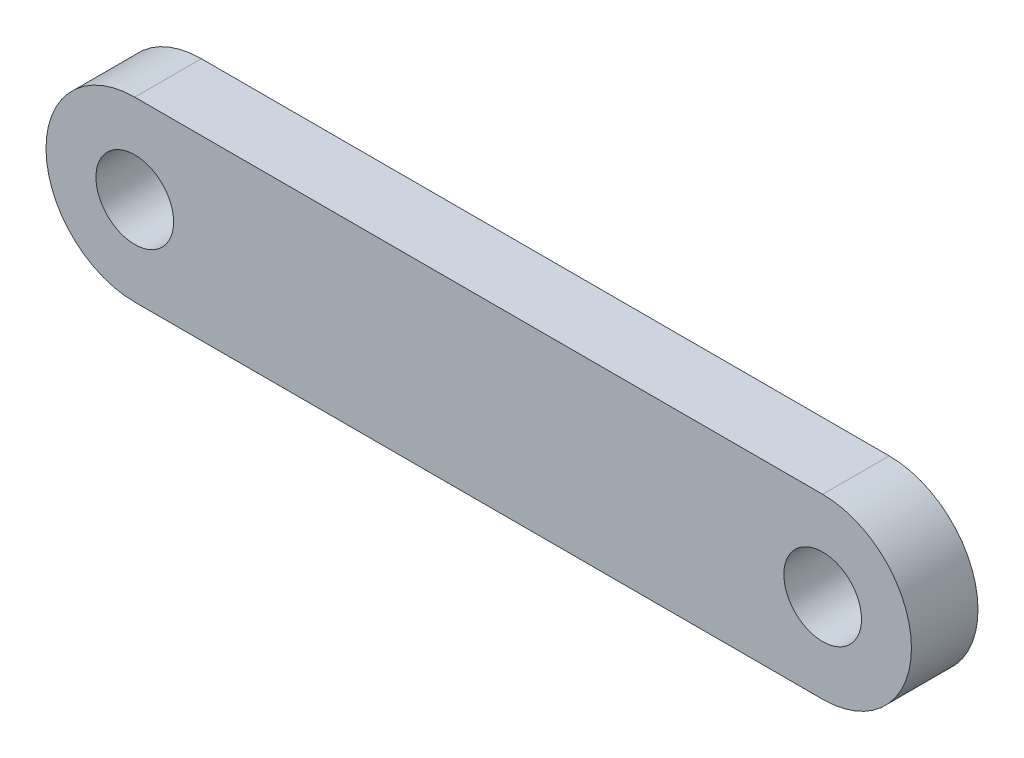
ISO-10303-21;
HEADER;
FILE_DESCRIPTION(('STEP AP214'),'2;1');
FILE_NAME('part.step','',(''),(''),'','','');
FILE_SCHEMA(('AUTOMOTIVE_DESIGN { 1 0 10303 214 1 1 1 1 }'));
ENDSEC;
DATA;
#1=APPLICATION_CONTEXT('core data for automotive mechanical design processes');
#2=APPLICATION_PROTOCOL_DEFINITION('international standard','automotive_design',2000,#1);
#3=PRODUCT_CONTEXT('',#1,'mechanical');
#4=PRODUCT('Part','Part','',(#3));
#5=PRODUCT_RELATED_PRODUCT_CATEGORY('part','',(#4));
#6=PRODUCT_DEFINITION_FORMATION('','',#4);
#7=PRODUCT_DEFINITION_CONTEXT('part definition',#1,'design');
#8=PRODUCT_DEFINITION('design','',#6,#7);
#9=PRODUCT_DEFINITION_SHAPE('','',#8);
#10=(LENGTH_UNIT() NAMED_UNIT(*) SI_UNIT(.MILLI.,.METRE.));
#11=(NAMED_UNIT(*) PLANE_ANGLE_UNIT() SI_UNIT($,.RADIAN.));
#12=(NAMED_UNIT(*) SI_UNIT($,.STERADIAN.) SOLID_ANGLE_UNIT());
#13=UNCERTAINTY_MEASURE_WITH_UNIT(LENGTH_MEASURE(1.E-05),#10,'distance_accuracy_value','');
#14=(GEOMETRIC_REPRESENTATION_CONTEXT(3) GLOBAL_UNCERTAINTY_ASSIGNED_CONTEXT((#13)) GLOBAL_UNIT_ASSIGNED_CONTEXT((#10,
#11,#12)) REPRESENTATION_CONTEXT('',''));
#15=CARTESIAN_POINT('',(0.,0.,0.));
#16=DIRECTION('',(0.,0.,1.));
#17=DIRECTION('',(1.,0.,0.));
#18=AXIS2_PLACEMENT_3D('',#15,#16,#17);
#19=CARTESIAN_POINT('',(0.,0.,3.));
#20=DIRECTION('',(0.,0.,1.));
#21=DIRECTION('',(1.,0.,0.));
#22=AXIS2_PLACEMENT_3D('',#19,#20,#21);
#23=PLANE('',#22);
#24=CARTESIAN_POINT('',(0.,0.,3.));
#25=DIRECTION('',(0.,0.,1.));
#26=DIRECTION('',(1.,0.,0.));
#27=AXIS2_PLACEMENT_3D('',#24,#25,#26);
#28=CIRCLE('',#27,1.75);
#29=CARTESIAN_POINT('',(1.75,0.,3.));
#30=VERTEX_POINT('',#29);
#31=EDGE_CURVE('E106',#30,#30,#28,.T.);
#32=ORIENTED_EDGE('',*,*,#31,.F.);
#33=EDGE_LOOP('',(#32));
#34=FACE_BOUND('',#33,.T.);
#35=CARTESIAN_POINT('',(0.,0.,3.));
#36=DIRECTION('',(0.,0.,1.));
#37=DIRECTION('',(1.,0.,0.));
#38=AXIS2_PLACEMENT_3D('',#35,#36,#37);
#39=CIRCLE('',#38,4.);
#40=CARTESIAN_POINT('',(0.,4.,3.));
#41=VERTEX_POINT('',#40);
#42=CARTESIAN_POINT('',(0.,-4.,3.));
#43=VERTEX_POINT('',#42);
#44=EDGE_CURVE('E91',#41,#43,#39,.T.);
#45=ORIENTED_EDGE('',*,*,#44,.T.);
#46=DIRECTION('',(1.,0.,0.));
#47=VECTOR('',#46,1.);
#48=CARTESIAN_POINT('',(0.,-4.,3.));
#49=LINE('',#48,#47);
#50=CARTESIAN_POINT('',(31.,-4.,3.));
#51=VERTEX_POINT('',#50);
#52=EDGE_CURVE('E86',#43,#51,#49,.T.);
#53=ORIENTED_EDGE('',*,*,#52,.T.);
#54=CARTESIAN_POINT('',(31.,0.,3.));
#55=DIRECTION('',(0.,0.,1.));
#56=DIRECTION('',(1.,0.,0.));
#57=AXIS2_PLACEMENT_3D('',#54,#55,#56);
#58=CIRCLE('',#57,4.);
#59=CARTESIAN_POINT('',(31.,4.,3.));
#60=VERTEX_POINT('',#59);
#61=EDGE_CURVE('E89',#51,#60,#58,.T.);
#62=ORIENTED_EDGE('',*,*,#61,.T.);
#63=DIRECTION('',(-1.,0.,0.));
#64=VECTOR('',#63,1.);
#65=CARTESIAN_POINT('',(0.,4.,3.));
#66=LINE('',#65,#64);
#67=EDGE_CURVE('E56',#60,#41,#66,.T.);
#68=ORIENTED_EDGE('',*,*,#67,.T.);
#69=EDGE_LOOP('',(#45,#53,#62,#68));
#70=FACE_BOUND('',#69,.T.);
#71=CARTESIAN_POINT('',(31.,0.,3.));
#72=DIRECTION('',(0.,0.,1.));
#73=DIRECTION('',(1.,0.,0.));
#74=AXIS2_PLACEMENT_3D('',#71,#72,#73);
#75=CIRCLE('',#74,1.75);
#76=CARTESIAN_POINT('',(32.75,0.,3.));
#77=VERTEX_POINT('',#76);
#78=EDGE_CURVE('E121',#77,#77,#75,.T.);
#79=ORIENTED_EDGE('',*,*,#78,.F.);
#80=EDGE_LOOP('',(#79));
#81=FACE_BOUND('',#80,.T.);
#82=ADVANCED_FACE('F39',(#34,#70,#81),#23,.T.);
#83=CARTESIAN_POINT('',(0.,0.,0.));
#84=DIRECTION('',(0.,0.,1.));
#85=DIRECTION('',(1.,0.,0.));
#86=AXIS2_PLACEMENT_3D('',#83,#84,#85);
#87=PLANE('',#86);
#88=CARTESIAN_POINT('',(0.,0.,0.));
#89=DIRECTION('',(0.,0.,1.));
#90=DIRECTION('',(1.,0.,0.));
#91=AXIS2_PLACEMENT_3D('',#88,#89,#90);
#92=CIRCLE('',#91,4.);
#93=CARTESIAN_POINT('',(0.,4.,0.));
#94=VERTEX_POINT('',#93);
#95=CARTESIAN_POINT('',(0.,-4.,0.));
#96=VERTEX_POINT('',#95);
#97=EDGE_CURVE('E103',#94,#96,#92,.T.);
#98=ORIENTED_EDGE('',*,*,#97,.F.);
#99=DIRECTION('',(-1.,0.,0.));
#100=VECTOR('',#99,1.);
#101=CARTESIAN_POINT('',(0.,4.,0.));
#102=LINE('',#101,#100);
#103=CARTESIAN_POINT('',(31.,4.,0.));
#104=VERTEX_POINT('',#103);
#105=EDGE_CURVE('E79',#104,#94,#102,.T.);
#106=ORIENTED_EDGE('',*,*,#105,.F.);
#107=CARTESIAN_POINT('',(31.,0.,0.));
#108=DIRECTION('',(0.,0.,1.));
#109=DIRECTION('',(1.,0.,0.));
#110=AXIS2_PLACEMENT_3D('',#107,#108,#109);
#111=CIRCLE('',#110,4.);
#112=CARTESIAN_POINT('',(31.,-4.,0.));
#113=VERTEX_POINT('',#112);
#114=EDGE_CURVE('E73',#113,#104,#111,.T.);
#115=ORIENTED_EDGE('',*,*,#114,.F.);
#116=DIRECTION('',(1.,0.,0.));
#117=VECTOR('',#116,1.);
#118=CARTESIAN_POINT('',(0.,-4.,0.));
#119=LINE('',#118,#117);
#120=EDGE_CURVE('E95',#96,#113,#119,.T.);
#121=ORIENTED_EDGE('',*,*,#120,.F.);
#122=EDGE_LOOP('',(#98,#106,#115,#121));
#123=FACE_BOUND('',#122,.T.);
#124=CARTESIAN_POINT('',(0.,0.,0.));
#125=DIRECTION('',(0.,0.,1.));
#126=DIRECTION('',(1.,0.,0.));
#127=AXIS2_PLACEMENT_3D('',#124,#125,#126);
#128=CIRCLE('',#127,1.75);
#129=CARTESIAN_POINT('',(1.75,0.,0.));
#130=VERTEX_POINT('',#129);
#131=EDGE_CURVE('E118',#130,#130,#128,.T.);
#132=ORIENTED_EDGE('',*,*,#131,.T.);
#133=EDGE_LOOP('',(#132));
#134=FACE_BOUND('',#133,.T.);
#135=CARTESIAN_POINT('',(31.,0.,0.));
#136=DIRECTION('',(0.,0.,1.));
#137=DIRECTION('',(1.,0.,0.));
#138=AXIS2_PLACEMENT_3D('',#135,#136,#137);
#139=CIRCLE('',#138,1.75);
#140=CARTESIAN_POINT('',(32.75,0.,0.));
#141=VERTEX_POINT('',#140);
#142=EDGE_CURVE('E124',#141,#141,#139,.T.);
#143=ORIENTED_EDGE('',*,*,#142,.T.);
#144=EDGE_LOOP('',(#143));
#145=FACE_BOUND('',#144,.T.);
#146=ADVANCED_FACE('F114',(#123,#134,#145),#87,.F.);
#147=CARTESIAN_POINT('',(0.,0.,3.));
#148=DIRECTION('',(0.,0.,-1.));
#149=DIRECTION('',(-1.,0.,0.));
#150=AXIS2_PLACEMENT_3D('',#147,#148,#149);
#151=CYLINDRICAL_SURFACE('',#150,4.);
#152=ORIENTED_EDGE('',*,*,#97,.T.);
#153=DIRECTION('',(0.,0.,-1.));
#154=VECTOR('',#153,1.);
#155=CARTESIAN_POINT('',(0.,-4.,3.));
#156=LINE('',#155,#154);
#157=EDGE_CURVE('E11',#43,#96,#156,.T.);
#158=ORIENTED_EDGE('',*,*,#157,.F.);
#159=ORIENTED_EDGE('',*,*,#44,.F.);
#160=DIRECTION('',(0.,0.,-1.));
#161=VECTOR('',#160,1.);
#162=CARTESIAN_POINT('',(0.,4.,3.));
#163=LINE('',#162,#161);
#164=EDGE_CURVE('E99',#41,#94,#163,.T.);
#165=ORIENTED_EDGE('',*,*,#164,.T.);
#166=EDGE_LOOP('',(#152,#158,#159,#165));
#167=FACE_BOUND('',#166,.T.);
#168=ADVANCED_FACE('F41',(#167),#151,.T.);
#169=CARTESIAN_POINT('',(0.,-4.,3.));
#170=DIRECTION('',(0.,1.,0.));
#171=DIRECTION('',(0.,0.,1.));
#172=AXIS2_PLACEMENT_3D('',#169,#170,#171);
#173=PLANE('',#172);
#174=ORIENTED_EDGE('',*,*,#120,.T.);
#175=DIRECTION('',(0.,0.,-1.));
#176=VECTOR('',#175,1.);
#177=CARTESIAN_POINT('',(31.,-4.,3.));
#178=LINE('',#177,#176);
#179=EDGE_CURVE('E48',#51,#113,#178,.T.);
#180=ORIENTED_EDGE('',*,*,#179,.F.);
#181=ORIENTED_EDGE('',*,*,#52,.F.);
#182=ORIENTED_EDGE('',*,*,#157,.T.);
#183=EDGE_LOOP('',(#174,#180,#181,#182));
#184=FACE_BOUND('',#183,.T.);
#185=ADVANCED_FACE('F94',(#184),#173,.F.);
#186=CARTESIAN_POINT('',(31.,0.,3.));
#187=DIRECTION('',(0.,0.,-1.));
#188=DIRECTION('',(-1.,0.,0.));
#189=AXIS2_PLACEMENT_3D('',#186,#187,#188);
#190=CYLINDRICAL_SURFACE('',#189,4.);
#191=ORIENTED_EDGE('',*,*,#114,.T.);
#192=DIRECTION('',(0.,0.,-1.));
#193=VECTOR('',#192,1.);
#194=CARTESIAN_POINT('',(31.,4.,3.));
#195=LINE('',#194,#193);
#196=EDGE_CURVE('E96',#60,#104,#195,.T.);
#197=ORIENTED_EDGE('',*,*,#196,.F.);
#198=ORIENTED_EDGE('',*,*,#61,.F.);
#199=ORIENTED_EDGE('',*,*,#179,.T.);
#200=EDGE_LOOP('',(#191,#197,#198,#199));
#201=FACE_BOUND('',#200,.T.);
#202=ADVANCED_FACE('F97',(#201),#190,.T.);
#203=CARTESIAN_POINT('',(0.,4.,3.));
#204=DIRECTION('',(0.,-1.,0.));
#205=DIRECTION('',(0.,0.,-1.));
#206=AXIS2_PLACEMENT_3D('',#203,#204,#205);
#207=PLANE('',#206);
#208=ORIENTED_EDGE('',*,*,#105,.T.);
#209=ORIENTED_EDGE('',*,*,#164,.F.);
#210=ORIENTED_EDGE('',*,*,#67,.F.);
#211=ORIENTED_EDGE('',*,*,#196,.T.);
#212=EDGE_LOOP('',(#208,#209,#210,#211));
#213=FACE_BOUND('',#212,.T.);
#214=ADVANCED_FACE('F111',(#213),#207,.F.);
#215=CARTESIAN_POINT('',(0.,0.,3.));
#216=DIRECTION('',(0.,0.,-1.));
#217=DIRECTION('',(-1.,0.,0.));
#218=AXIS2_PLACEMENT_3D('',#215,#216,#217);
#219=CYLINDRICAL_SURFACE('',#218,1.75);
#220=ORIENTED_EDGE('',*,*,#31,.T.);
#221=EDGE_LOOP('',(#220));
#222=FACE_BOUND('',#221,.T.);
#223=ORIENTED_EDGE('',*,*,#131,.F.);
#224=EDGE_LOOP('',(#223));
#225=FACE_BOUND('',#224,.T.);
#226=ADVANCED_FACE('F141',(#222,#225),#219,.F.);
#227=CARTESIAN_POINT('',(31.,0.,3.));
#228=DIRECTION('',(0.,0.,-1.));
#229=DIRECTION('',(-1.,0.,0.));
#230=AXIS2_PLACEMENT_3D('',#227,#228,#229);
#231=CYLINDRICAL_SURFACE('',#230,1.75);
#232=ORIENTED_EDGE('',*,*,#78,.T.);
#233=EDGE_LOOP('',(#232));
#234=FACE_BOUND('',#233,.T.);
#235=ORIENTED_EDGE('',*,*,#142,.F.);
#236=EDGE_LOOP('',(#235));
#237=FACE_BOUND('',#236,.T.);
#238=ADVANCED_FACE('F130',(#234,#237),#231,.F.);
#239=CLOSED_SHELL('',(#82,#146,#168,#185,#202,#214,#226,#238));
#240=MANIFOLD_SOLID_BREP('B2',#239);
#241=ADVANCED_BREP_SHAPE_REPRESENTATION('',(#18,#240),#14);
#242=SHAPE_DEFINITION_REPRESENTATION(#9,#241);
ENDSEC;
END-ISO-10303-21;
